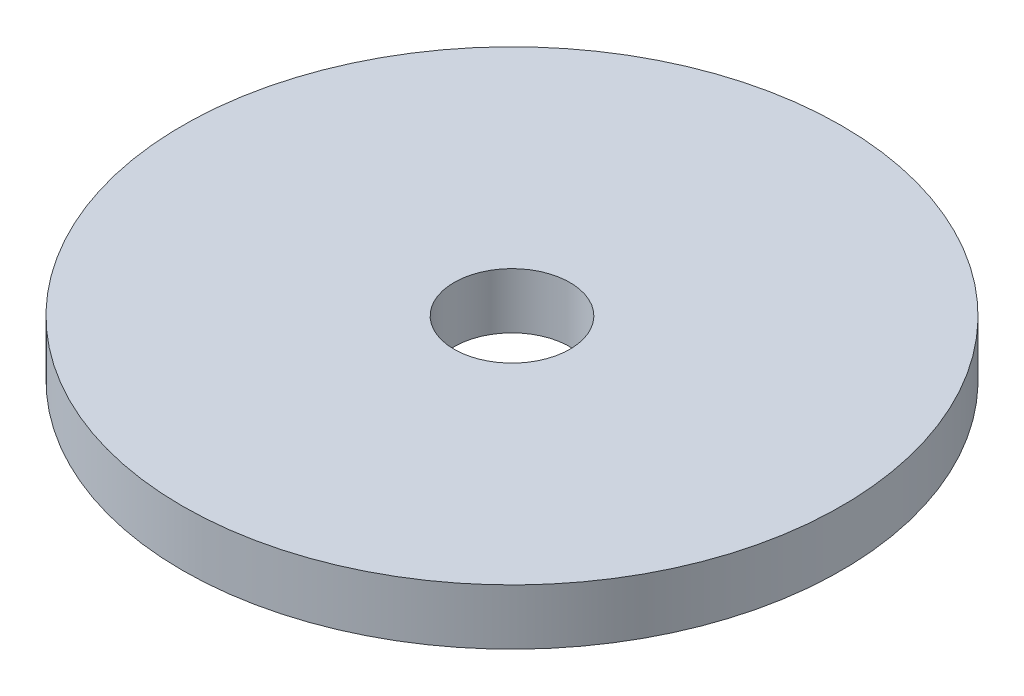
ISO-10303-21;
HEADER;
FILE_DESCRIPTION(('STEP AP214'),'2;1');
FILE_NAME('part.step','',(''),(''),'','','');
FILE_SCHEMA(('AUTOMOTIVE_DESIGN { 1 0 10303 214 1 1 1 1 }'));
ENDSEC;
DATA;
#1=APPLICATION_CONTEXT('core data for automotive mechanical design processes');
#2=APPLICATION_PROTOCOL_DEFINITION('international standard','automotive_design',2000,#1);
#3=PRODUCT_CONTEXT('',#1,'mechanical');
#4=PRODUCT('Part','Part','',(#3));
#5=PRODUCT_RELATED_PRODUCT_CATEGORY('part','',(#4));
#6=PRODUCT_DEFINITION_FORMATION('','',#4);
#7=PRODUCT_DEFINITION_CONTEXT('part definition',#1,'design');
#8=PRODUCT_DEFINITION('design','',#6,#7);
#9=PRODUCT_DEFINITION_SHAPE('','',#8);
#10=(LENGTH_UNIT() NAMED_UNIT(*) SI_UNIT(.MILLI.,.METRE.));
#11=(NAMED_UNIT(*) PLANE_ANGLE_UNIT() SI_UNIT($,.RADIAN.));
#12=(NAMED_UNIT(*) SI_UNIT($,.STERADIAN.) SOLID_ANGLE_UNIT());
#13=UNCERTAINTY_MEASURE_WITH_UNIT(LENGTH_MEASURE(1.E-05),#10,'distance_accuracy_value','');
#14=(GEOMETRIC_REPRESENTATION_CONTEXT(3) GLOBAL_UNCERTAINTY_ASSIGNED_CONTEXT((#13)) GLOBAL_UNIT_ASSIGNED_CONTEXT((#10,
#11,#12)) REPRESENTATION_CONTEXT('',''));
#15=CARTESIAN_POINT('',(0.,0.,0.));
#16=DIRECTION('',(0.,0.,1.));
#17=DIRECTION('',(1.,0.,0.));
#18=AXIS2_PLACEMENT_3D('',#15,#16,#17);
#19=CARTESIAN_POINT('',(0.,3.175,0.));
#20=DIRECTION('',(0.,1.,0.));
#21=DIRECTION('',(0.,0.,1.));
#22=AXIS2_PLACEMENT_3D('',#19,#20,#21);
#23=PLANE('',#22);
#24=CARTESIAN_POINT('',(0.,3.175,0.));
#25=DIRECTION('',(0.,1.,0.));
#26=DIRECTION('',(0.,0.,1.));
#27=AXIS2_PLACEMENT_3D('',#24,#25,#26);
#28=CIRCLE('',#27,18.796);
#29=CARTESIAN_POINT('',(0.,3.175,18.796));
#30=VERTEX_POINT('',#29);
#31=EDGE_CURVE('E10',#30,#30,#28,.T.);
#32=ORIENTED_EDGE('',*,*,#31,.T.);
#33=EDGE_LOOP('',(#32));
#34=FACE_BOUND('',#33,.T.);
#35=CARTESIAN_POINT('',(0.,3.175,0.));
#36=DIRECTION('',(0.,1.,0.));
#37=DIRECTION('',(0.,0.,1.));
#38=AXIS2_PLACEMENT_3D('',#35,#36,#37);
#39=CIRCLE('',#38,3.302);
#40=CARTESIAN_POINT('',(0.,3.175,3.302));
#41=VERTEX_POINT('',#40);
#42=EDGE_CURVE('E40',#41,#41,#39,.T.);
#43=ORIENTED_EDGE('',*,*,#42,.F.);
#44=EDGE_LOOP('',(#43));
#45=FACE_BOUND('',#44,.T.);
#46=ADVANCED_FACE('F29',(#34,#45),#23,.T.);
#47=CARTESIAN_POINT('',(0.,0.,0.));
#48=DIRECTION('',(0.,1.,0.));
#49=DIRECTION('',(0.,0.,1.));
#50=AXIS2_PLACEMENT_3D('',#47,#48,#49);
#51=PLANE('',#50);
#52=CARTESIAN_POINT('',(0.,0.,0.));
#53=DIRECTION('',(0.,1.,0.));
#54=DIRECTION('',(0.,0.,1.));
#55=AXIS2_PLACEMENT_3D('',#52,#53,#54);
#56=CIRCLE('',#55,18.796);
#57=CARTESIAN_POINT('',(0.,0.,18.796));
#58=VERTEX_POINT('',#57);
#59=EDGE_CURVE('E33',#58,#58,#56,.T.);
#60=ORIENTED_EDGE('',*,*,#59,.F.);
#61=EDGE_LOOP('',(#60));
#62=FACE_BOUND('',#61,.T.);
#63=CARTESIAN_POINT('',(0.,0.,0.));
#64=DIRECTION('',(0.,1.,0.));
#65=DIRECTION('',(0.,0.,1.));
#66=AXIS2_PLACEMENT_3D('',#63,#64,#65);
#67=CIRCLE('',#66,3.302);
#68=CARTESIAN_POINT('',(0.,0.,3.302));
#69=VERTEX_POINT('',#68);
#70=EDGE_CURVE('E42',#69,#69,#67,.T.);
#71=ORIENTED_EDGE('',*,*,#70,.T.);
#72=EDGE_LOOP('',(#71));
#73=FACE_BOUND('',#72,.T.);
#74=ADVANCED_FACE('F52',(#62,#73),#51,.F.);
#75=CARTESIAN_POINT('',(0.,3.175,0.));
#76=DIRECTION('',(0.,-1.,0.));
#77=DIRECTION('',(0.,0.,-1.));
#78=AXIS2_PLACEMENT_3D('',#75,#76,#77);
#79=CYLINDRICAL_SURFACE('',#78,18.796);
#80=ORIENTED_EDGE('',*,*,#31,.F.);
#81=EDGE_LOOP('',(#80));
#82=FACE_BOUND('',#81,.T.);
#83=ORIENTED_EDGE('',*,*,#59,.T.);
#84=EDGE_LOOP('',(#83));
#85=FACE_BOUND('',#84,.T.);
#86=ADVANCED_FACE('F31',(#82,#85),#79,.T.);
#87=CARTESIAN_POINT('',(0.,3.175,0.));
#88=DIRECTION('',(0.,-1.,0.));
#89=DIRECTION('',(0.,0.,-1.));
#90=AXIS2_PLACEMENT_3D('',#87,#88,#89);
#91=CYLINDRICAL_SURFACE('',#90,3.302);
#92=ORIENTED_EDGE('',*,*,#42,.T.);
#93=EDGE_LOOP('',(#92));
#94=FACE_BOUND('',#93,.T.);
#95=ORIENTED_EDGE('',*,*,#70,.F.);
#96=EDGE_LOOP('',(#95));
#97=FACE_BOUND('',#96,.T.);
#98=ADVANCED_FACE('F48',(#94,#97),#91,.F.);
#99=CLOSED_SHELL('',(#46,#74,#86,#98));
#100=MANIFOLD_SOLID_BREP('B2',#99);
#101=ADVANCED_BREP_SHAPE_REPRESENTATION('',(#18,#100),#14);
#102=SHAPE_DEFINITION_REPRESENTATION(#9,#101);
ENDSEC;
END-ISO-10303-21;
